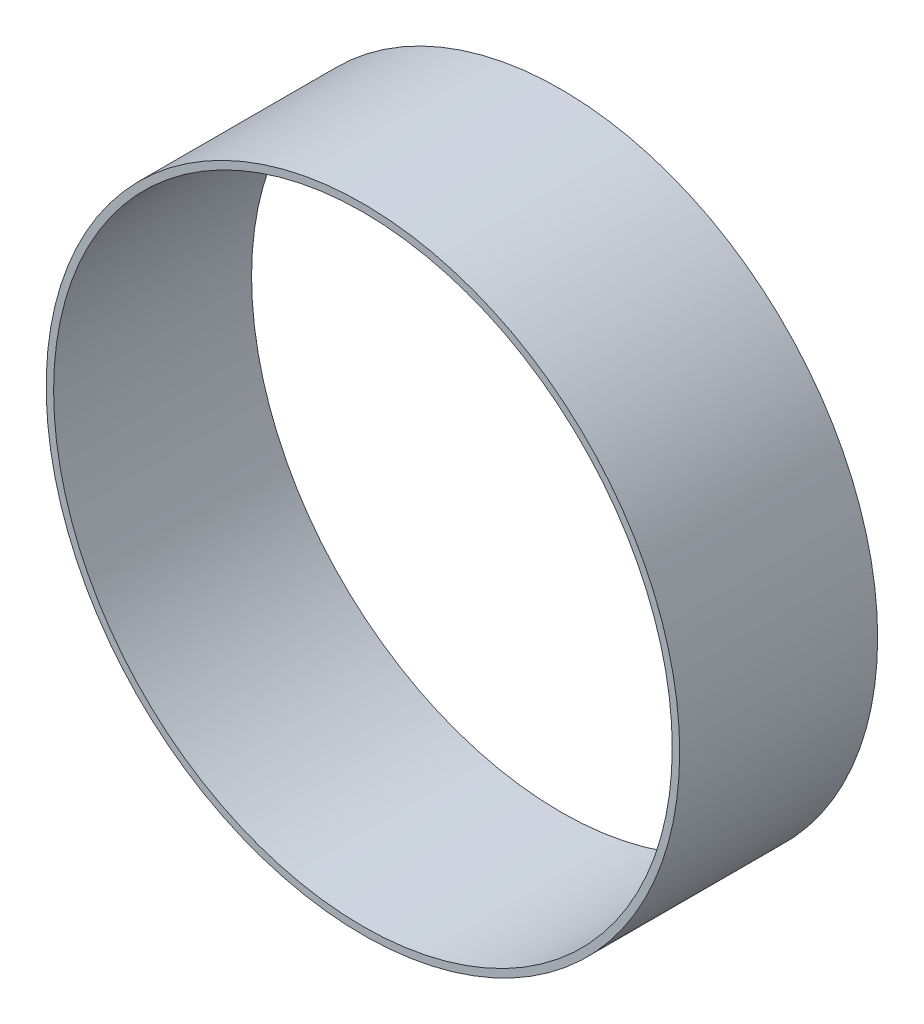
ISO-10303-21;
HEADER;
FILE_DESCRIPTION(('STEP AP214'),'2;1');
FILE_NAME('part.step','',(''),(''),'','','');
FILE_SCHEMA(('AUTOMOTIVE_DESIGN { 1 0 10303 214 1 1 1 1 }'));
ENDSEC;
DATA;
#1=APPLICATION_CONTEXT('core data for automotive mechanical design processes');
#2=APPLICATION_PROTOCOL_DEFINITION('international standard','automotive_design',2000,#1);
#3=PRODUCT_CONTEXT('',#1,'mechanical');
#4=PRODUCT('Part','Part','',(#3));
#5=PRODUCT_RELATED_PRODUCT_CATEGORY('part','',(#4));
#6=PRODUCT_DEFINITION_FORMATION('','',#4);
#7=PRODUCT_DEFINITION_CONTEXT('part definition',#1,'design');
#8=PRODUCT_DEFINITION('design','',#6,#7);
#9=PRODUCT_DEFINITION_SHAPE('','',#8);
#10=(LENGTH_UNIT() NAMED_UNIT(*) SI_UNIT(.MILLI.,.METRE.));
#11=(NAMED_UNIT(*) PLANE_ANGLE_UNIT() SI_UNIT($,.RADIAN.));
#12=(NAMED_UNIT(*) SI_UNIT($,.STERADIAN.) SOLID_ANGLE_UNIT());
#13=UNCERTAINTY_MEASURE_WITH_UNIT(LENGTH_MEASURE(1.E-05),#10,'distance_accuracy_value','');
#14=(GEOMETRIC_REPRESENTATION_CONTEXT(3) GLOBAL_UNCERTAINTY_ASSIGNED_CONTEXT((#13)) GLOBAL_UNIT_ASSIGNED_CONTEXT((#10,
#11,#12)) REPRESENTATION_CONTEXT('',''));
#15=CARTESIAN_POINT('',(0.,0.,0.));
#16=DIRECTION('',(0.,0.,1.));
#17=DIRECTION('',(1.,0.,0.));
#18=AXIS2_PLACEMENT_3D('',#15,#16,#17);
#19=CARTESIAN_POINT('',(0.,0.,80.));
#20=DIRECTION('',(0.,0.,1.));
#21=DIRECTION('',(1.,0.,0.));
#22=AXIS2_PLACEMENT_3D('',#19,#20,#21);
#23=PLANE('',#22);
#24=CARTESIAN_POINT('',(0.,0.,80.));
#25=DIRECTION('',(0.,0.,1.));
#26=DIRECTION('',(1.,0.,0.));
#27=AXIS2_PLACEMENT_3D('',#24,#25,#26);
#28=CIRCLE('',#27,125.);
#29=CARTESIAN_POINT('',(125.,0.,80.));
#30=VERTEX_POINT('',#29);
#31=EDGE_CURVE('E19',#30,#30,#28,.T.);
#32=ORIENTED_EDGE('',*,*,#31,.F.);
#33=EDGE_LOOP('',(#32));
#34=FACE_BOUND('',#33,.T.);
#35=CARTESIAN_POINT('',(0.,0.,80.));
#36=DIRECTION('',(0.,0.,1.));
#37=DIRECTION('',(1.,0.,0.));
#38=AXIS2_PLACEMENT_3D('',#35,#36,#37);
#39=CIRCLE('',#38,128.);
#40=CARTESIAN_POINT('',(128.,0.,80.));
#41=VERTEX_POINT('',#40);
#42=EDGE_CURVE('E58',#41,#41,#39,.T.);
#43=ORIENTED_EDGE('',*,*,#42,.T.);
#44=EDGE_LOOP('',(#43));
#45=FACE_BOUND('',#44,.T.);
#46=ADVANCED_FACE('F16',(#34,#45),#23,.T.);
#47=CARTESIAN_POINT('',(0.,0.,0.));
#48=DIRECTION('',(0.,0.,1.));
#49=DIRECTION('',(1.,0.,0.));
#50=AXIS2_PLACEMENT_3D('',#47,#48,#49);
#51=PLANE('',#50);
#52=CARTESIAN_POINT('',(0.,0.,0.));
#53=DIRECTION('',(0.,0.,1.));
#54=DIRECTION('',(1.,0.,0.));
#55=AXIS2_PLACEMENT_3D('',#52,#53,#54);
#56=CIRCLE('',#55,125.);
#57=CARTESIAN_POINT('',(125.,0.,0.));
#58=VERTEX_POINT('',#57);
#59=EDGE_CURVE('E10',#58,#58,#56,.T.);
#60=ORIENTED_EDGE('',*,*,#59,.T.);
#61=EDGE_LOOP('',(#60));
#62=FACE_BOUND('',#61,.T.);
#63=CARTESIAN_POINT('',(0.,0.,0.));
#64=DIRECTION('',(0.,0.,1.));
#65=DIRECTION('',(1.,0.,0.));
#66=AXIS2_PLACEMENT_3D('',#63,#64,#65);
#67=CIRCLE('',#66,128.);
#68=CARTESIAN_POINT('',(128.,0.,0.));
#69=VERTEX_POINT('',#68);
#70=EDGE_CURVE('E57',#69,#69,#67,.T.);
#71=ORIENTED_EDGE('',*,*,#70,.F.);
#72=EDGE_LOOP('',(#71));
#73=FACE_BOUND('',#72,.T.);
#74=ADVANCED_FACE('F87',(#62,#73),#51,.F.);
#75=CARTESIAN_POINT('',(0.,0.,0.));
#76=DIRECTION('',(0.,0.,-1.));
#77=DIRECTION('',(1.,0.,0.));
#78=AXIS2_PLACEMENT_3D('',#75,#76,#77);
#79=CYLINDRICAL_SURFACE('',#78,125.);
#80=DIRECTION('',(0.,0.,1.));
#81=VECTOR('',#80,1.);
#82=CARTESIAN_POINT('',(125.,0.,0.));
#83=LINE('',#82,#81);
#84=EDGE_CURVE('E64',#58,#30,#83,.T.);
#85=ORIENTED_EDGE('',*,*,#84,.T.);
#86=ORIENTED_EDGE('',*,*,#31,.T.);
#87=ORIENTED_EDGE('',*,*,#84,.F.);
#88=ORIENTED_EDGE('',*,*,#59,.F.);
#89=EDGE_LOOP('',(#85,#86,#87,#88));
#90=FACE_BOUND('',#89,.T.);
#91=ADVANCED_FACE('F78',(#90),#79,.F.);
#92=CARTESIAN_POINT('',(0.,0.,0.));
#93=DIRECTION('',(0.,0.,-1.));
#94=DIRECTION('',(1.,0.,0.));
#95=AXIS2_PLACEMENT_3D('',#92,#93,#94);
#96=CYLINDRICAL_SURFACE('',#95,128.);
#97=ORIENTED_EDGE('',*,*,#70,.T.);
#98=DIRECTION('',(0.,0.,1.));
#99=VECTOR('',#98,1.);
#100=CARTESIAN_POINT('',(128.,0.,0.));
#101=LINE('',#100,#99);
#102=EDGE_CURVE('E54',#69,#41,#101,.T.);
#103=ORIENTED_EDGE('',*,*,#102,.T.);
#104=ORIENTED_EDGE('',*,*,#42,.F.);
#105=ORIENTED_EDGE('',*,*,#102,.F.);
#106=EDGE_LOOP('',(#97,#103,#104,#105));
#107=FACE_BOUND('',#106,.T.);
#108=ADVANCED_FACE('F55',(#107),#96,.T.);
#109=CLOSED_SHELL('',(#46,#74,#91,#108));
#110=MANIFOLD_SOLID_BREP('B1',#109);
#111=ADVANCED_BREP_SHAPE_REPRESENTATION('',(#18,#110),#14);
#112=SHAPE_DEFINITION_REPRESENTATION(#9,#111);
ENDSEC;
END-ISO-10303-21;
